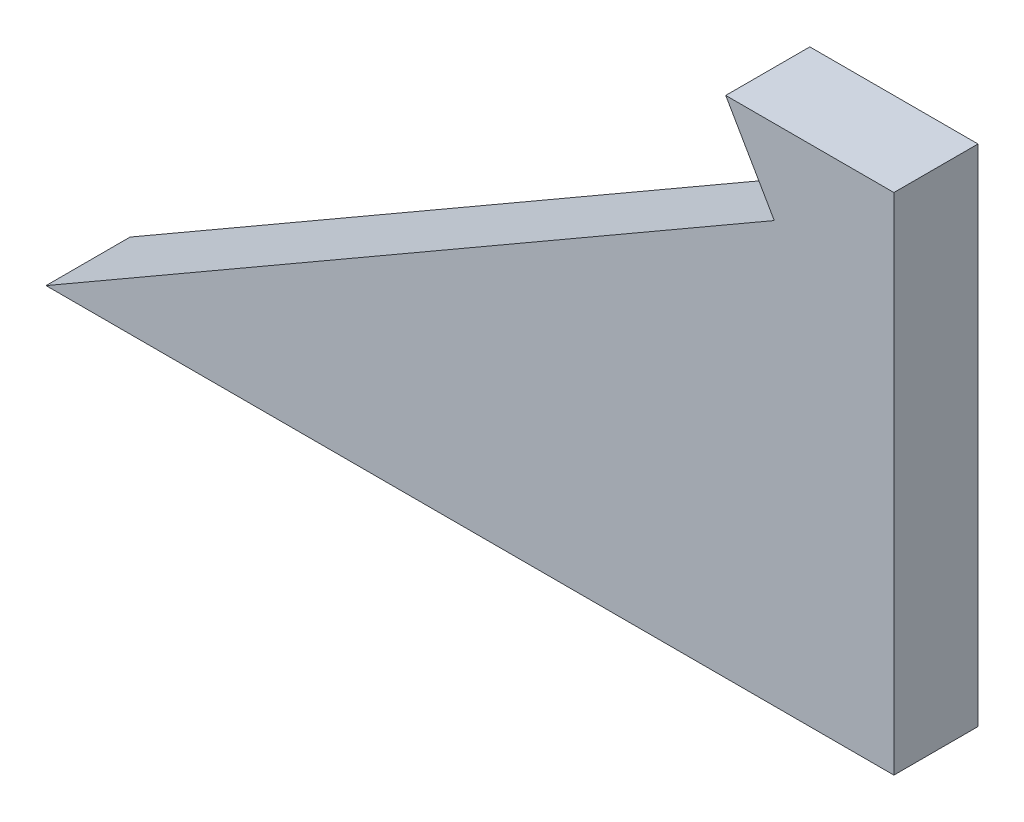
ISO-10303-21;
HEADER;
FILE_DESCRIPTION(('STEP AP214'),'2;1');
FILE_NAME('part.step','',(''),(''),'','','');
FILE_SCHEMA(('AUTOMOTIVE_DESIGN { 1 0 10303 214 1 1 1 1 }'));
ENDSEC;
DATA;
#1=APPLICATION_CONTEXT('core data for automotive mechanical design processes');
#2=APPLICATION_PROTOCOL_DEFINITION('international standard','automotive_design',2000,#1);
#3=PRODUCT_CONTEXT('',#1,'mechanical');
#4=PRODUCT('Part','Part','',(#3));
#5=PRODUCT_RELATED_PRODUCT_CATEGORY('part','',(#4));
#6=PRODUCT_DEFINITION_FORMATION('','',#4);
#7=PRODUCT_DEFINITION_CONTEXT('part definition',#1,'design');
#8=PRODUCT_DEFINITION('design','',#6,#7);
#9=PRODUCT_DEFINITION_SHAPE('','',#8);
#10=(LENGTH_UNIT() NAMED_UNIT(*) SI_UNIT(.MILLI.,.METRE.));
#11=(NAMED_UNIT(*) PLANE_ANGLE_UNIT() SI_UNIT($,.RADIAN.));
#12=(NAMED_UNIT(*) SI_UNIT($,.STERADIAN.) SOLID_ANGLE_UNIT());
#13=UNCERTAINTY_MEASURE_WITH_UNIT(LENGTH_MEASURE(1.E-05),#10,'distance_accuracy_value','');
#14=(GEOMETRIC_REPRESENTATION_CONTEXT(3) GLOBAL_UNCERTAINTY_ASSIGNED_CONTEXT((#13)) GLOBAL_UNIT_ASSIGNED_CONTEXT((#10,
#11,#12)) REPRESENTATION_CONTEXT('',''));
#15=CARTESIAN_POINT('',(0.,0.,0.));
#16=DIRECTION('',(0.,0.,1.));
#17=DIRECTION('',(1.,0.,0.));
#18=AXIS2_PLACEMENT_3D('',#15,#16,#17);
#19=CARTESIAN_POINT('',(0.,0.,-12.7));
#20=DIRECTION('',(-0.866025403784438,-0.500000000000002,0.));
#21=DIRECTION('',(0.500000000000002,-0.866025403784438,0.));
#22=AXIS2_PLACEMENT_3D('',#19,#20,#21);
#23=PLANE('',#22);
#24=DIRECTION('',(0.500000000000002,-0.866025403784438,0.));
#25=VECTOR('',#24,1.);
#26=CARTESIAN_POINT('',(0.,0.,12.7));
#27=LINE('',#26,#25);
#28=CARTESIAN_POINT('',(-14.6646968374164,25.3999999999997,12.7));
#29=VERTEX_POINT('',#28);
#30=CARTESIAN_POINT('',(0.,0.,12.7));
#31=VERTEX_POINT('',#30);
#32=EDGE_CURVE('E109',#29,#31,#27,.T.);
#33=ORIENTED_EDGE('',*,*,#32,.F.);
#34=DIRECTION('',(0.,0.,1.));
#35=VECTOR('',#34,1.);
#36=CARTESIAN_POINT('',(-14.6646968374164,25.3999999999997,-12.7));
#37=LINE('',#36,#35);
#38=CARTESIAN_POINT('',(-14.6646968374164,25.3999999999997,-12.7));
#39=VERTEX_POINT('',#38);
#40=EDGE_CURVE('E11',#39,#29,#37,.T.);
#41=ORIENTED_EDGE('',*,*,#40,.F.);
#42=DIRECTION('',(0.500000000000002,-0.866025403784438,0.));
#43=VECTOR('',#42,1.);
#44=CARTESIAN_POINT('',(0.,0.,-12.7));
#45=LINE('',#44,#43);
#46=CARTESIAN_POINT('',(0.,0.,-12.7));
#47=VERTEX_POINT('',#46);
#48=EDGE_CURVE('E104',#39,#47,#45,.T.);
#49=ORIENTED_EDGE('',*,*,#48,.T.);
#50=DIRECTION('',(0.,0.,1.));
#51=VECTOR('',#50,1.);
#52=CARTESIAN_POINT('',(0.,0.,-12.7));
#53=LINE('',#52,#51);
#54=EDGE_CURVE('E35',#47,#31,#53,.T.);
#55=ORIENTED_EDGE('',*,*,#54,.T.);
#56=EDGE_LOOP('',(#33,#41,#49,#55));
#57=FACE_BOUND('',#56,.T.);
#58=ADVANCED_FACE('F32',(#57),#23,.T.);
#59=CARTESIAN_POINT('',(-14.6646968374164,25.3999999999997,-12.7));
#60=DIRECTION('',(0.,1.,0.));
#61=DIRECTION('',(0.,0.,1.));
#62=AXIS2_PLACEMENT_3D('',#59,#60,#61);
#63=PLANE('',#62);
#64=DIRECTION('',(-1.,0.,0.));
#65=VECTOR('',#64,1.);
#66=CARTESIAN_POINT('',(-14.6646968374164,25.3999999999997,12.7));
#67=LINE('',#66,#65);
#68=CARTESIAN_POINT('',(36.1353031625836,25.3999999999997,12.7));
#69=VERTEX_POINT('',#68);
#70=EDGE_CURVE('E118',#69,#29,#67,.T.);
#71=ORIENTED_EDGE('',*,*,#70,.F.);
#72=DIRECTION('',(0.,0.,1.));
#73=VECTOR('',#72,1.);
#74=CARTESIAN_POINT('',(36.1353031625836,25.3999999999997,-12.7));
#75=LINE('',#74,#73);
#76=CARTESIAN_POINT('',(36.1353031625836,25.3999999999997,-12.7));
#77=VERTEX_POINT('',#76);
#78=EDGE_CURVE('E41',#77,#69,#75,.T.);
#79=ORIENTED_EDGE('',*,*,#78,.F.);
#80=DIRECTION('',(-1.,0.,0.));
#81=VECTOR('',#80,1.);
#82=CARTESIAN_POINT('',(-14.6646968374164,25.3999999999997,-12.7));
#83=LINE('',#82,#81);
#84=EDGE_CURVE('E99',#77,#39,#83,.T.);
#85=ORIENTED_EDGE('',*,*,#84,.T.);
#86=ORIENTED_EDGE('',*,*,#40,.T.);
#87=EDGE_LOOP('',(#71,#79,#85,#86));
#88=FACE_BOUND('',#87,.T.);
#89=ADVANCED_FACE('F124',(#88),#63,.T.);
#90=CARTESIAN_POINT('',(36.1353031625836,25.3999999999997,-12.7));
#91=DIRECTION('',(1.,0.,0.));
#92=DIRECTION('',(0.,1.,0.));
#93=AXIS2_PLACEMENT_3D('',#90,#91,#92);
#94=PLANE('',#93);
#95=DIRECTION('',(0.,1.,0.));
#96=VECTOR('',#95,1.);
#97=CARTESIAN_POINT('',(36.1353031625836,25.3999999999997,12.7));
#98=LINE('',#97,#96);
#99=CARTESIAN_POINT('',(36.1353031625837,-127.,12.7));
#100=VERTEX_POINT('',#99);
#101=EDGE_CURVE('E88',#100,#69,#98,.T.);
#102=ORIENTED_EDGE('',*,*,#101,.F.);
#103=DIRECTION('',(0.,0.,1.));
#104=VECTOR('',#103,1.);
#105=CARTESIAN_POINT('',(36.1353031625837,-127.,-12.7));
#106=LINE('',#105,#104);
#107=CARTESIAN_POINT('',(36.1353031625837,-127.,-12.7));
#108=VERTEX_POINT('',#107);
#109=EDGE_CURVE('E83',#108,#100,#106,.T.);
#110=ORIENTED_EDGE('',*,*,#109,.F.);
#111=DIRECTION('',(0.,1.,0.));
#112=VECTOR('',#111,1.);
#113=CARTESIAN_POINT('',(36.1353031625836,25.3999999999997,-12.7));
#114=LINE('',#113,#112);
#115=EDGE_CURVE('E86',#108,#77,#114,.T.);
#116=ORIENTED_EDGE('',*,*,#115,.T.);
#117=ORIENTED_EDGE('',*,*,#78,.T.);
#118=EDGE_LOOP('',(#102,#110,#116,#117));
#119=FACE_BOUND('',#118,.T.);
#120=ADVANCED_FACE('F85',(#119),#94,.T.);
#121=CARTESIAN_POINT('',(36.1353031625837,-127.,-12.7));
#122=DIRECTION('',(0.,-1.,0.));
#123=DIRECTION('',(1.,0.,0.));
#124=AXIS2_PLACEMENT_3D('',#121,#122,#123);
#125=PLANE('',#124);
#126=DIRECTION('',(1.,0.,0.));
#127=VECTOR('',#126,1.);
#128=CARTESIAN_POINT('',(36.1353031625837,-127.,12.7));
#129=LINE('',#128,#127);
#130=CARTESIAN_POINT('',(-219.970452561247,-127.,12.7));
#131=VERTEX_POINT('',#130);
#132=EDGE_CURVE('E115',#131,#100,#129,.T.);
#133=ORIENTED_EDGE('',*,*,#132,.F.);
#134=DIRECTION('',(0.,0.,1.));
#135=VECTOR('',#134,1.);
#136=CARTESIAN_POINT('',(-219.970452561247,-127.,-12.7));
#137=LINE('',#136,#135);
#138=CARTESIAN_POINT('',(-219.970452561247,-127.,-12.7));
#139=VERTEX_POINT('',#138);
#140=EDGE_CURVE('E93',#139,#131,#137,.T.);
#141=ORIENTED_EDGE('',*,*,#140,.F.);
#142=DIRECTION('',(1.,0.,0.));
#143=VECTOR('',#142,1.);
#144=CARTESIAN_POINT('',(36.1353031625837,-127.,-12.7));
#145=LINE('',#144,#143);
#146=EDGE_CURVE('E98',#139,#108,#145,.T.);
#147=ORIENTED_EDGE('',*,*,#146,.T.);
#148=ORIENTED_EDGE('',*,*,#109,.T.);
#149=EDGE_LOOP('',(#133,#141,#147,#148));
#150=FACE_BOUND('',#149,.T.);
#151=ADVANCED_FACE('F101',(#150),#125,.T.);
#152=CARTESIAN_POINT('',(0.,0.,-12.7));
#153=DIRECTION('',(-0.500000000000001,0.866025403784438,0.));
#154=DIRECTION('',(-0.866025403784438,-0.500000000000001,0.));
#155=AXIS2_PLACEMENT_3D('',#152,#153,#154);
#156=PLANE('',#155);
#157=DIRECTION('',(-0.866025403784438,-0.500000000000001,0.));
#158=VECTOR('',#157,1.);
#159=CARTESIAN_POINT('',(0.,0.,12.7));
#160=LINE('',#159,#158);
#161=EDGE_CURVE('E112',#31,#131,#160,.T.);
#162=ORIENTED_EDGE('',*,*,#161,.F.);
#163=ORIENTED_EDGE('',*,*,#54,.F.);
#164=DIRECTION('',(-0.866025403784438,-0.500000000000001,0.));
#165=VECTOR('',#164,1.);
#166=CARTESIAN_POINT('',(0.,0.,-12.7));
#167=LINE('',#166,#165);
#168=EDGE_CURVE('E102',#47,#139,#167,.T.);
#169=ORIENTED_EDGE('',*,*,#168,.T.);
#170=ORIENTED_EDGE('',*,*,#140,.T.);
#171=EDGE_LOOP('',(#162,#163,#169,#170));
#172=FACE_BOUND('',#171,.T.);
#173=ADVANCED_FACE('F121',(#172),#156,.T.);
#174=CARTESIAN_POINT('',(0.,0.,-12.7));
#175=DIRECTION('',(0.,0.,1.));
#176=DIRECTION('',(1.,0.,0.));
#177=AXIS2_PLACEMENT_3D('',#174,#175,#176);
#178=PLANE('',#177);
#179=ORIENTED_EDGE('',*,*,#48,.F.);
#180=ORIENTED_EDGE('',*,*,#84,.F.);
#181=ORIENTED_EDGE('',*,*,#115,.F.);
#182=ORIENTED_EDGE('',*,*,#146,.F.);
#183=ORIENTED_EDGE('',*,*,#168,.F.);
#184=EDGE_LOOP('',(#179,#180,#181,#182,#183));
#185=FACE_BOUND('',#184,.T.);
#186=ADVANCED_FACE('F97',(#185),#178,.F.);
#187=CARTESIAN_POINT('',(0.,0.,12.7));
#188=DIRECTION('',(0.,0.,1.));
#189=DIRECTION('',(1.,0.,0.));
#190=AXIS2_PLACEMENT_3D('',#187,#188,#189);
#191=PLANE('',#190);
#192=ORIENTED_EDGE('',*,*,#32,.T.);
#193=ORIENTED_EDGE('',*,*,#161,.T.);
#194=ORIENTED_EDGE('',*,*,#132,.T.);
#195=ORIENTED_EDGE('',*,*,#101,.T.);
#196=ORIENTED_EDGE('',*,*,#70,.T.);
#197=EDGE_LOOP('',(#192,#193,#194,#195,#196));
#198=FACE_BOUND('',#197,.T.);
#199=ADVANCED_FACE('F123',(#198),#191,.T.);
#200=CLOSED_SHELL('',(#58,#89,#120,#151,#173,#186,#199));
#201=MANIFOLD_SOLID_BREP('B2',#200);
#202=ADVANCED_BREP_SHAPE_REPRESENTATION('',(#18,#201),#14);
#203=SHAPE_DEFINITION_REPRESENTATION(#9,#202);
ENDSEC;
END-ISO-10303-21;
